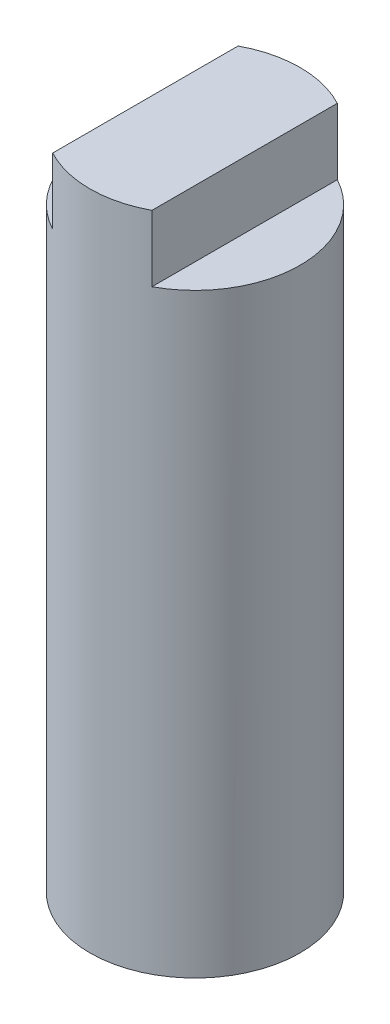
from build123d import *

# Parameters (mm, degrees)
SKETCH1_R           = 3.1775
BOSS_EXTRUDE1_DEPTH = 10
SKETCH2_OUTSIDE_W   = 12.742
SKETCH2_OUTSIDE_H   = 12.742
SKETCH2_OUTSIDE_W_2 = 3
SKETCH2_OUTSIDE_H_2 = 6.88508423
CUT_EXTRUDE1_DEPTH  = 2


with BuildPart() as part:
    # Sketch1 → Boss-Extrude1 (new, symmetric)
    with BuildSketch(Plane(origin=(0, 0, 0), x_dir=(1, 0, 0), z_dir=(0, 1, 0))):
        with Locations(Location((0, 0, 0), (0, 0, 270))):
            Circle(SKETCH1_R)
    extrude(amount=BOSS_EXTRUDE1_DEPTH, both=True)

    # Sketch2 outside → Cut-Extrude1 (cut)
    with BuildSketch(Plane(origin=(0, 10, 0), x_dir=(1, 0, 0), z_dir=(0, 1, 0))):
        Rectangle(SKETCH2_OUTSIDE_W, SKETCH2_OUTSIDE_H)
        Rectangle(SKETCH2_OUTSIDE_W_2, SKETCH2_OUTSIDE_H_2, mode=Mode.SUBTRACT)
    extrude(amount=-CUT_EXTRUDE1_DEPTH, mode=Mode.SUBTRACT)


solid = part.part
